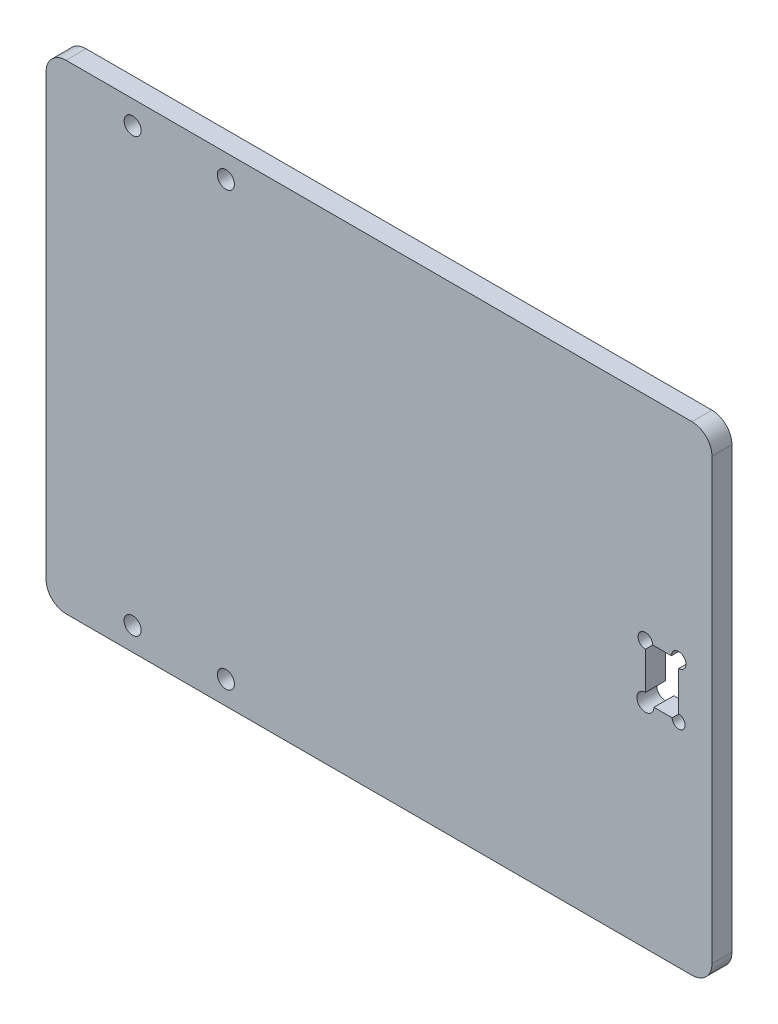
from build123d import *

# Parameters (mm, degrees)
EXTRUSION1_DEPTH        = 3
ESQUISSE2_W             = 5
ESQUISSE2_H             = 8
ENL_V_MAT_EXTRU_1_DEPTH = 124.259888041
ESQUISSE3_R             = 1.281571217
ESQUISSE3_R_2           = 1.09810269
ESQUISSE3_R_3           = 1.1
ESQUISSE3_R_4           = 0.978749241
ESQUISSE3_R_5           = 1.288411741
ENL_V_MAT_EXTRU_2_DEPTH = 124.259888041


with BuildPart() as part:
    # Esquisse1 → Extrusion1 (new body)
    with BuildSketch(Plane.XY):
        with BuildLine():
            Line((3, 0), (97, 0))
            ThreePointArc((97, 0), (99.121320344, 0.878679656), (100, 3))
            Line((100, 3), (100, 69))
            ThreePointArc((100, 69), (99.121320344, 71.121320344), (97, 72))
            Line((97, 72), (3, 72))
            ThreePointArc((3, 72), (0.878679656, 71.121320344), (0, 69))
            Line((0, 69), (0, 3))
            ThreePointArc((0, 3), (0.878679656, 0.878679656), (3, 0))
        make_face()
    extrude(amount=EXTRUSION1_DEPTH)

    # Esquisse2 → Enl_v. mat.-Extru.1 (cut, through all)
    with BuildSketch(Plane.XY.offset(3)):
        with Locations((92.5, 36)):
            Rectangle(ESQUISSE2_W, ESQUISSE2_H)
    extrude(amount=-ENL_V_MAT_EXTRU_1_DEPTH, mode=Mode.SUBTRACT)

    # Esquisse3 → Enl_v. mat.-Extru.2 (cut, through all)
    with BuildSketch(Plane.XY.offset(3)):
        with Locations((13, 68.5)):
            Circle(ESQUISSE3_R)
        with Locations((27, 68.5)):
            Circle(ESQUISSE3_R)
        with Locations((27, 3.5)):
            Circle(ESQUISSE3_R)
        with Locations((13, 3.5)):
            Circle(ESQUISSE3_R)
        with Locations((90, 40)):
            Circle(ESQUISSE3_R_2)
        with Locations((95, 40)):
            Circle(ESQUISSE3_R_3)
        with Locations((95, 32)):
            Circle(ESQUISSE3_R_4)
        with Locations((90, 32)):
            Circle(ESQUISSE3_R_5)
    extrude(amount=-ENL_V_MAT_EXTRU_2_DEPTH, mode=Mode.SUBTRACT)


solid = part.part
